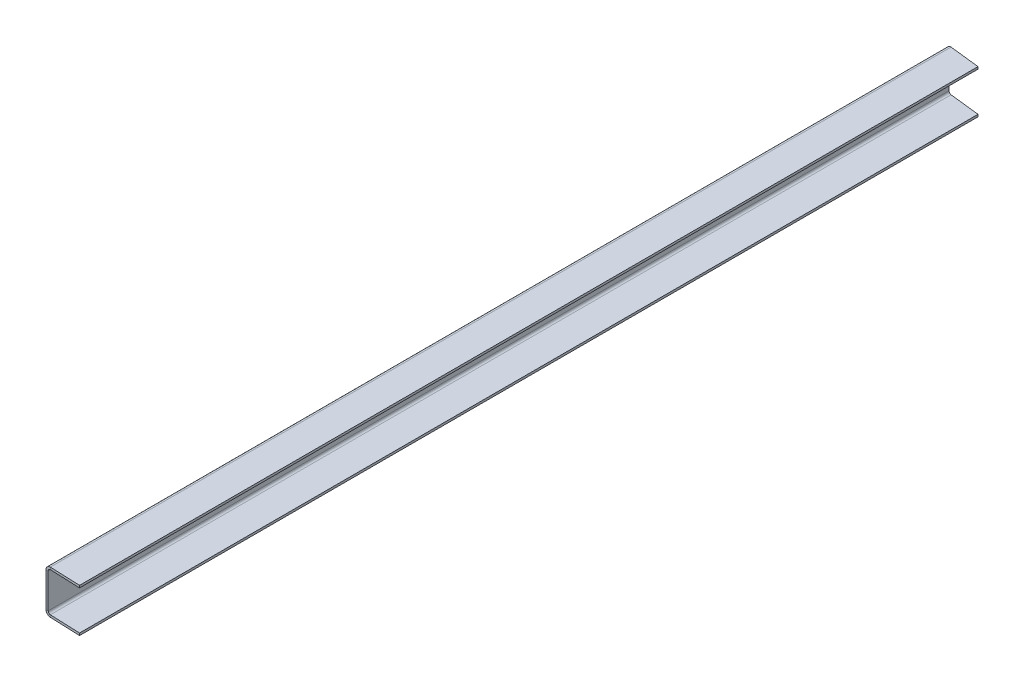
ISO-10303-21;
HEADER;
FILE_DESCRIPTION(('STEP AP214'),'2;1');
FILE_NAME('part.step','',(''),(''),'','','');
FILE_SCHEMA(('AUTOMOTIVE_DESIGN { 1 0 10303 214 1 1 1 1 }'));
ENDSEC;
DATA;
#1=APPLICATION_CONTEXT('core data for automotive mechanical design processes');
#2=APPLICATION_PROTOCOL_DEFINITION('international standard','automotive_design',2000,#1);
#3=PRODUCT_CONTEXT('',#1,'mechanical');
#4=PRODUCT('Part','Part','',(#3));
#5=PRODUCT_RELATED_PRODUCT_CATEGORY('part','',(#4));
#6=PRODUCT_DEFINITION_FORMATION('','',#4);
#7=PRODUCT_DEFINITION_CONTEXT('part definition',#1,'design');
#8=PRODUCT_DEFINITION('design','',#6,#7);
#9=PRODUCT_DEFINITION_SHAPE('','',#8);
#10=(LENGTH_UNIT() NAMED_UNIT(*) SI_UNIT(.MILLI.,.METRE.));
#11=(NAMED_UNIT(*) PLANE_ANGLE_UNIT() SI_UNIT($,.RADIAN.));
#12=(NAMED_UNIT(*) SI_UNIT($,.STERADIAN.) SOLID_ANGLE_UNIT());
#13=UNCERTAINTY_MEASURE_WITH_UNIT(LENGTH_MEASURE(1.E-05),#10,'distance_accuracy_value','');
#14=(GEOMETRIC_REPRESENTATION_CONTEXT(3) GLOBAL_UNCERTAINTY_ASSIGNED_CONTEXT((#13)) GLOBAL_UNIT_ASSIGNED_CONTEXT((#10,
#11,#12)) REPRESENTATION_CONTEXT('',''));
#15=CARTESIAN_POINT('',(0.,0.,0.));
#16=DIRECTION('',(0.,0.,1.));
#17=DIRECTION('',(1.,0.,0.));
#18=AXIS2_PLACEMENT_3D('',#15,#16,#17);
#19=CARTESIAN_POINT('',(2931.20159668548,0.,-1293.76501369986));
#20=DIRECTION('',(0.,0.,1.));
#21=DIRECTION('',(0.,-1.,0.));
#22=AXIS2_PLACEMENT_3D('',#19,#20,#21);
#23=PLANE('',#22);
#24=DIRECTION('',(1.,0.,0.));
#25=VECTOR('',#24,1.);
#26=CARTESIAN_POINT('',(2931.20159668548,781.78922918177,-1293.76501369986));
#27=LINE('',#26,#25);
#28=CARTESIAN_POINT('',(2929.57599668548,781.78922918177,-1293.76501369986));
#29=VERTEX_POINT('',#28);
#30=CARTESIAN_POINT('',(2931.20159668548,781.78922918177,-1293.76501369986));
#31=VERTEX_POINT('',#30);
#32=EDGE_CURVE('E12',#29,#31,#27,.T.);
#33=ORIENTED_EDGE('',*,*,#32,.F.);
#34=DIRECTION('',(0.,1.,0.));
#35=VECTOR('',#34,1.);
#36=CARTESIAN_POINT('',(2929.57599668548,0.,-1293.76501369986));
#37=LINE('',#36,#35);
#38=CARTESIAN_POINT('',(2929.57599668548,807.036829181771,-1293.76501369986));
#39=VERTEX_POINT('',#38);
#40=EDGE_CURVE('E137',#39,#29,#37,.F.);
#41=ORIENTED_EDGE('',*,*,#40,.F.);
#42=DIRECTION('',(1.,1.36592399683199E-13,0.));
#43=VECTOR('',#42,1.);
#44=CARTESIAN_POINT('',(2931.20159668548,807.036829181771,-1293.76501369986));
#45=LINE('',#44,#43);
#46=CARTESIAN_POINT('',(2931.20159668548,807.036829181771,-1293.76501369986));
#47=VERTEX_POINT('',#46);
#48=EDGE_CURVE('E90',#39,#47,#45,.T.);
#49=ORIENTED_EDGE('',*,*,#48,.T.);
#50=DIRECTION('',(0.,-1.,0.));
#51=VECTOR('',#50,1.);
#52=CARTESIAN_POINT('',(2931.20159668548,0.,-1293.76501369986));
#53=LINE('',#52,#51);
#54=EDGE_CURVE('E139',#47,#31,#53,.T.);
#55=ORIENTED_EDGE('',*,*,#54,.T.);
#56=EDGE_LOOP('',(#33,#41,#49,#55));
#57=FACE_BOUND('',#56,.T.);
#58=ADVANCED_FACE('F78',(#57),#23,.F.);
#59=CARTESIAN_POINT('',(2936.07839668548,807.036829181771,-1293.3968247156));
#60=CARTESIAN_POINT('',(2935.53653001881,807.036829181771,-1293.3968247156));
#61=CARTESIAN_POINT('',(2934.99466335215,807.036829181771,-1293.3968247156));
#62=CARTESIAN_POINT('',(2934.45279668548,807.036829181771,-1293.3968247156));
#63=CARTESIAN_POINT('',(2936.07839668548,800.534429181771,-1293.3968247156));
#64=CARTESIAN_POINT('',(2935.53653001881,801.618162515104,-1293.3968247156));
#65=CARTESIAN_POINT('',(2934.99466335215,802.701895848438,-1293.3968247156));
#66=CARTESIAN_POINT('',(2934.45279668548,803.785629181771,-1293.3968247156));
#67=CARTESIAN_POINT('',(2929.57599668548,800.534429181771,-1293.76501369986));
#68=CARTESIAN_POINT('',(2930.11786335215,801.618162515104,-1293.76501369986));
#69=CARTESIAN_POINT('',(2930.65973001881,802.701895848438,-1293.76501369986));
#70=CARTESIAN_POINT('',(2931.20159668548,803.785629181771,-1293.76501369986));
#71=CARTESIAN_POINT('',(2929.57599668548,807.036829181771,-1293.76501369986));
#72=CARTESIAN_POINT('',(2930.11786335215,807.036829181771,-1293.76501369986));
#73=CARTESIAN_POINT('',(2930.65973001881,807.036829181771,-1293.76501369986));
#74=CARTESIAN_POINT('',(2931.20159668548,807.036829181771,-1293.76501369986));
#75=CARTESIAN_POINT('',(2929.57599668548,813.539229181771,-1293.76501369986));
#76=CARTESIAN_POINT('',(2930.11786335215,812.455495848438,-1293.76501369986));
#77=CARTESIAN_POINT('',(2930.65973001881,811.371762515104,-1293.76501369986));
#78=CARTESIAN_POINT('',(2931.20159668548,810.288029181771,-1293.76501369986));
#79=CARTESIAN_POINT('',(2936.07839668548,813.539229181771,-1293.3968247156));
#80=CARTESIAN_POINT('',(2935.53653001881,812.455495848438,-1293.3968247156));
#81=CARTESIAN_POINT('',(2934.99466335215,811.371762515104,-1293.3968247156));
#82=CARTESIAN_POINT('',(2934.45279668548,810.288029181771,-1293.3968247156));
#83=CARTESIAN_POINT('',(2936.07839668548,807.036829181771,-1293.3968247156));
#84=CARTESIAN_POINT('',(2935.53653001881,807.036829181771,-1293.3968247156));
#85=CARTESIAN_POINT('',(2934.99466335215,807.036829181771,-1293.3968247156));
#86=CARTESIAN_POINT('',(2934.45279668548,807.036829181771,-1293.3968247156));
#87=(BOUNDED_SURFACE() B_SPLINE_SURFACE(3,3,((#59,#60,#61,#62),(#63,#64,#65,#66),(#67,#68,#69,
#70),(#71,#72,#73,#74),(#75,#76,#77,#78),(#79,#80,#81,#82),(#83,#84,#85,#86)),.UNSPECIFIED.,.T.,
.F.,.F.) B_SPLINE_SURFACE_WITH_KNOTS((4,3,4),(4,4),(0.,0.5,1.),(0.,1.),
.UNSPECIFIED.) GEOMETRIC_REPRESENTATION_ITEM() RATIONAL_B_SPLINE_SURFACE(((1.,1.,1.,1.),
(0.333333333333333,0.333333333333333,0.333333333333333,0.333333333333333),(0.333333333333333,
0.333333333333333,0.333333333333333,0.333333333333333),(1.,1.,1.,1.),(0.333333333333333,
0.333333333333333,0.333333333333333,0.333333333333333),(0.333333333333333,0.333333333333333,
0.333333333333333,0.333333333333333),(1.,1.,1.,1.))) REPRESENTATION_ITEM('') SURFACE());
#88=CARTESIAN_POINT('',(2932.82719668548,807.036829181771,-1293.58091920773));
#89=DIRECTION('',(-0.0565329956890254,0.,0.998400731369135));
#90=DIRECTION('',(0.998400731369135,0.,0.0565329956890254));
#91=AXIS2_PLACEMENT_3D('',#88,#89,#90);
#92=ELLIPSE('',#91,3.25640787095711,3.2512);
#93=CARTESIAN_POINT('',(2932.82719668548,810.288029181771,-1293.58091920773));
#94=VERTEX_POINT('',#93);
#95=EDGE_CURVE('E215',#39,#94,#92,.F.);
#96=DIRECTION('',(0.,-1.,0.));
#97=VECTOR('',#96,1.);
#98=CARTESIAN_POINT('',(2932.82719668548,808.662429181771,-1293.58091920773));
#99=LINE('',#98,#97);
#100=CARTESIAN_POINT('',(2932.82719668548,808.662429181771,-1293.58091920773));
#101=VERTEX_POINT('',#100);
#102=EDGE_CURVE('E205',#94,#101,#99,.T.);
#103=CARTESIAN_POINT('',(2932.82719668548,807.036829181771,-1293.58091920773));
#104=DIRECTION('',(-0.112527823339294,0.,0.993648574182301));
#105=DIRECTION('',(0.993648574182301,0.,0.112527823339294));
#106=AXIS2_PLACEMENT_3D('',#103,#104,#105);
#107=ELLIPSE('',#106,1.63599087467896,1.6256);
#108=EDGE_CURVE('E213',#47,#101,#107,.F.);
#109=ORIENTED_EDGE('',*,*,#48,.F.);
#110=ORIENTED_EDGE('',*,*,#95,.T.);
#111=ORIENTED_EDGE('',*,*,#102,.T.);
#112=ORIENTED_EDGE('',*,*,#108,.F.);
#113=EDGE_LOOP('',(#109,#110,#111,#112));
#114=FACE_BOUND('',#113,.T.);
#115=ADVANCED_FACE('F212',(#114),#87,.T.);
#116=CARTESIAN_POINT('',(2929.5863215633,808.662429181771,-1293.94793892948));
#117=DIRECTION('',(-0.112527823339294,0.,0.993648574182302));
#118=DIRECTION('',(-0.993648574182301,0.,-0.112527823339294));
#119=AXIS2_PLACEMENT_3D('',#116,#117,#118);
#120=PLANE('',#119);
#121=ORIENTED_EDGE('',*,*,#102,.F.);
#122=DIRECTION('',(-0.993648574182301,0.,-0.112527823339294));
#123=VECTOR('',#122,1.);
#124=CARTESIAN_POINT('',(2929.5863215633,810.288029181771,-1293.94793892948));
#125=LINE('',#124,#123);
#126=CARTESIAN_POINT('',(2954.9863215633,810.288029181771,-1291.07146248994));
#127=VERTEX_POINT('',#126);
#128=EDGE_CURVE('E176',#127,#94,#125,.T.);
#129=ORIENTED_EDGE('',*,*,#128,.F.);
#130=DIRECTION('',(0.,-1.,0.));
#131=VECTOR('',#130,1.);
#132=CARTESIAN_POINT('',(2954.9863215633,808.662429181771,-1291.07146248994));
#133=LINE('',#132,#131);
#134=CARTESIAN_POINT('',(2954.9863215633,808.662429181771,-1291.07146248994));
#135=VERTEX_POINT('',#134);
#136=EDGE_CURVE('E202',#127,#135,#133,.T.);
#137=ORIENTED_EDGE('',*,*,#136,.T.);
#138=DIRECTION('',(-0.993648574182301,0.,-0.112527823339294));
#139=VECTOR('',#138,1.);
#140=CARTESIAN_POINT('',(2929.5863215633,808.662429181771,-1293.94793892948));
#141=LINE('',#140,#139);
#142=EDGE_CURVE('E232',#135,#101,#141,.T.);
#143=ORIENTED_EDGE('',*,*,#142,.T.);
#144=EDGE_LOOP('',(#121,#129,#137,#143));
#145=FACE_BOUND('',#144,.T.);
#146=ADVANCED_FACE('F233',(#145),#120,.F.);
#147=CARTESIAN_POINT('',(2954.9863215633,808.662429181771,-1291.07146248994));
#148=DIRECTION('',(-1.,0.,0.));
#149=DIRECTION('',(0.,0.,-1.));
#150=AXIS2_PLACEMENT_3D('',#147,#148,#149);
#151=PLANE('',#150);
#152=ORIENTED_EDGE('',*,*,#136,.F.);
#153=DIRECTION('',(0.,0.,-1.));
#154=VECTOR('',#153,1.);
#155=CARTESIAN_POINT('',(2954.9863215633,810.288029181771,0.));
#156=LINE('',#155,#154);
#157=CARTESIAN_POINT('',(2954.9863215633,810.288029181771,-635.693927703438));
#158=VERTEX_POINT('',#157);
#159=EDGE_CURVE('E168',#158,#127,#156,.T.);
#160=ORIENTED_EDGE('',*,*,#159,.F.);
#161=DIRECTION('',(0.,-1.,0.));
#162=VECTOR('',#161,1.);
#163=CARTESIAN_POINT('',(2954.9863215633,808.662429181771,-635.693927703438));
#164=LINE('',#163,#162);
#165=CARTESIAN_POINT('',(2954.9863215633,808.662429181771,-635.693927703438));
#166=VERTEX_POINT('',#165);
#167=EDGE_CURVE('E199',#158,#166,#164,.T.);
#168=ORIENTED_EDGE('',*,*,#167,.T.);
#169=DIRECTION('',(0.,0.,-1.));
#170=VECTOR('',#169,1.);
#171=CARTESIAN_POINT('',(2954.9863215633,808.662429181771,-1291.07146248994));
#172=LINE('',#171,#170);
#173=EDGE_CURVE('E237',#166,#135,#172,.T.);
#174=ORIENTED_EDGE('',*,*,#173,.T.);
#175=EDGE_LOOP('',(#152,#160,#168,#174));
#176=FACE_BOUND('',#175,.T.);
#177=ADVANCED_FACE('F280',(#176),#151,.F.);
#178=CARTESIAN_POINT('',(2954.9863215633,808.662429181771,-635.693927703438));
#179=DIRECTION('',(0.0397709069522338,0.,-0.999208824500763));
#180=DIRECTION('',(0.999208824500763,0.,0.0397709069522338));
#181=AXIS2_PLACEMENT_3D('',#178,#179,#180);
#182=PLANE('',#181);
#183=ORIENTED_EDGE('',*,*,#167,.F.);
#184=DIRECTION('',(0.999208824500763,0.,0.0397709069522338));
#185=VECTOR('',#184,1.);
#186=CARTESIAN_POINT('',(2954.9863215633,810.288029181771,-635.693927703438));
#187=LINE('',#186,#185);
#188=CARTESIAN_POINT('',(2932.82719668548,810.288029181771,-636.575914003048));
#189=VERTEX_POINT('',#188);
#190=EDGE_CURVE('E173',#189,#158,#187,.T.);
#191=ORIENTED_EDGE('',*,*,#190,.F.);
#192=DIRECTION('',(0.,-1.,0.));
#193=VECTOR('',#192,1.);
#194=CARTESIAN_POINT('',(2932.82719668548,808.662429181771,-636.575914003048));
#195=LINE('',#194,#193);
#196=CARTESIAN_POINT('',(2932.82719668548,808.662429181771,-636.575914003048));
#197=VERTEX_POINT('',#196);
#198=EDGE_CURVE('E196',#189,#197,#195,.T.);
#199=ORIENTED_EDGE('',*,*,#198,.T.);
#200=DIRECTION('',(0.999208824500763,0.,0.0397709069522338));
#201=VECTOR('',#200,1.);
#202=CARTESIAN_POINT('',(2954.9863215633,808.662429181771,-635.693927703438));
#203=LINE('',#202,#201);
#204=EDGE_CURVE('E238',#197,#166,#203,.T.);
#205=ORIENTED_EDGE('',*,*,#204,.T.);
#206=EDGE_LOOP('',(#183,#191,#199,#205));
#207=FACE_BOUND('',#206,.T.);
#208=ADVANCED_FACE('F307',(#207),#182,.F.);
#209=CARTESIAN_POINT('',(2936.07839668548,807.036829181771,-636.511211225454));
#210=CARTESIAN_POINT('',(2935.53653001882,807.036829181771,-636.511211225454));
#211=CARTESIAN_POINT('',(2934.99466335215,807.036829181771,-636.511211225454));
#212=CARTESIAN_POINT('',(2934.45279668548,807.036829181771,-636.511211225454));
#213=CARTESIAN_POINT('',(2936.07839668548,813.539229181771,-636.511211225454));
#214=CARTESIAN_POINT('',(2935.53653001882,812.455495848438,-636.511211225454));
#215=CARTESIAN_POINT('',(2934.99466335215,811.371762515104,-636.511211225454));
#216=CARTESIAN_POINT('',(2934.45279668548,810.288029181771,-636.511211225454));
#217=CARTESIAN_POINT('',(2929.57599668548,813.539229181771,-636.640616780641));
#218=CARTESIAN_POINT('',(2930.11786335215,812.455495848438,-636.640616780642));
#219=CARTESIAN_POINT('',(2930.65973001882,811.371762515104,-636.640616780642));
#220=CARTESIAN_POINT('',(2931.20159668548,810.288029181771,-636.640616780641));
#221=CARTESIAN_POINT('',(2929.57599668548,807.036829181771,-636.640616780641));
#222=CARTESIAN_POINT('',(2930.11786335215,807.036829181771,-636.640616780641));
#223=CARTESIAN_POINT('',(2930.65973001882,807.036829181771,-636.640616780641));
#224=CARTESIAN_POINT('',(2931.20159668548,807.036829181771,-636.640616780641));
#225=CARTESIAN_POINT('',(2929.57599668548,800.534429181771,-636.640616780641));
#226=CARTESIAN_POINT('',(2930.11786335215,801.618162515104,-636.640616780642));
#227=CARTESIAN_POINT('',(2930.65973001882,802.701895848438,-636.640616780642));
#228=CARTESIAN_POINT('',(2931.20159668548,803.785629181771,-636.640616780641));
#229=CARTESIAN_POINT('',(2936.07839668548,800.534429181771,-636.511211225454));
#230=CARTESIAN_POINT('',(2935.53653001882,801.618162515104,-636.511211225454));
#231=CARTESIAN_POINT('',(2934.99466335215,802.701895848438,-636.511211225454));
#232=CARTESIAN_POINT('',(2934.45279668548,803.785629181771,-636.511211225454));
#233=CARTESIAN_POINT('',(2936.07839668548,807.036829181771,-636.511211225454));
#234=CARTESIAN_POINT('',(2935.53653001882,807.036829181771,-636.511211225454));
#235=CARTESIAN_POINT('',(2934.99466335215,807.036829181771,-636.511211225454));
#236=CARTESIAN_POINT('',(2934.45279668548,807.036829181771,-636.511211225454));
#237=(BOUNDED_SURFACE() B_SPLINE_SURFACE(3,3,((#209,#210,#211,#212),(#213,#214,#215,#216),(#217,
#218,#219,#220),(#221,#222,#223,#224),(#225,#226,#227,#228),(#229,#230,#231,#232),(#233,#234,
#235,#236)),.UNSPECIFIED.,.T.,.F.,.F.) B_SPLINE_SURFACE_WITH_KNOTS((4,3,4),(4,4),(0.,0.5,1.),
(0.,1.),.UNSPECIFIED.) GEOMETRIC_REPRESENTATION_ITEM() RATIONAL_B_SPLINE_SURFACE(((1.,1.,1.,1.),
(0.333333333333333,0.333333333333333,0.333333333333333,0.333333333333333),(0.333333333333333,
0.333333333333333,0.333333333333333,0.333333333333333),(1.,1.,1.,1.),(0.333333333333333,
0.333333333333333,0.333333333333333,0.333333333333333),(0.333333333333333,0.333333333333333,
0.333333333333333,0.333333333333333),(1.,1.,1.,1.))) REPRESENTATION_ITEM('') SURFACE());
#238=CARTESIAN_POINT('',(2932.82719668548,807.036829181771,-636.575914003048));
#239=DIRECTION('',(0.0198972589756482,0.,-0.999802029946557));
#240=DIRECTION('',(0.999802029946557,0.,0.0198972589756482));
#241=AXIS2_PLACEMENT_3D('',#238,#239,#240);
#242=ELLIPSE('',#241,3.25184376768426,3.2512);
#243=CARTESIAN_POINT('',(2929.57599668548,807.036829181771,-636.640616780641));
#244=VERTEX_POINT('',#243);
#245=EDGE_CURVE('E178',#189,#244,#242,.F.);
#246=DIRECTION('',(1.,0.,0.));
#247=VECTOR('',#246,1.);
#248=CARTESIAN_POINT('',(2931.20159668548,807.036829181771,-636.640616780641));
#249=LINE('',#248,#247);
#250=CARTESIAN_POINT('',(2931.20159668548,807.036829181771,-636.640616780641));
#251=VERTEX_POINT('',#250);
#252=EDGE_CURVE('E194',#244,#251,#249,.T.);
#253=CARTESIAN_POINT('',(2932.82719668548,807.036829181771,-636.575914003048));
#254=DIRECTION('',(0.0397709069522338,0.,-0.999208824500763));
#255=DIRECTION('',(0.999208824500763,0.,0.0397709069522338));
#256=AXIS2_PLACEMENT_3D('',#253,#254,#255);
#257=ELLIPSE('',#256,1.62688715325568,1.6256);
#258=EDGE_CURVE('E229',#197,#251,#257,.F.);
#259=ORIENTED_EDGE('',*,*,#198,.F.);
#260=ORIENTED_EDGE('',*,*,#245,.T.);
#261=ORIENTED_EDGE('',*,*,#252,.T.);
#262=ORIENTED_EDGE('',*,*,#258,.F.);
#263=EDGE_LOOP('',(#259,#260,#261,#262));
#264=FACE_BOUND('',#263,.T.);
#265=ADVANCED_FACE('F357',(#264),#237,.T.);
#266=CARTESIAN_POINT('',(2931.20159668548,0.,-636.640616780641));
#267=DIRECTION('',(0.,0.,-1.));
#268=DIRECTION('',(0.,1.,0.));
#269=AXIS2_PLACEMENT_3D('',#266,#267,#268);
#270=PLANE('',#269);
#271=ORIENTED_EDGE('',*,*,#252,.F.);
#272=DIRECTION('',(0.,1.,0.));
#273=VECTOR('',#272,1.);
#274=CARTESIAN_POINT('',(2929.57599668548,0.,-636.640616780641));
#275=LINE('',#274,#273);
#276=CARTESIAN_POINT('',(2929.57599668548,781.789229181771,-636.640616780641));
#277=VERTEX_POINT('',#276);
#278=EDGE_CURVE('E167',#277,#244,#275,.T.);
#279=ORIENTED_EDGE('',*,*,#278,.F.);
#280=DIRECTION('',(1.,0.,0.));
#281=VECTOR('',#280,1.);
#282=CARTESIAN_POINT('',(2931.20159668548,781.789229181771,-636.640616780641));
#283=LINE('',#282,#281);
#284=CARTESIAN_POINT('',(2931.20159668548,781.789229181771,-636.640616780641));
#285=VERTEX_POINT('',#284);
#286=EDGE_CURVE('E191',#277,#285,#283,.T.);
#287=ORIENTED_EDGE('',*,*,#286,.T.);
#288=DIRECTION('',(0.,1.,0.));
#289=VECTOR('',#288,1.);
#290=CARTESIAN_POINT('',(2931.20159668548,0.,-636.640616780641));
#291=LINE('',#290,#289);
#292=EDGE_CURVE('E284',#285,#251,#291,.T.);
#293=ORIENTED_EDGE('',*,*,#292,.T.);
#294=EDGE_LOOP('',(#271,#279,#287,#293));
#295=FACE_BOUND('',#294,.T.);
#296=ADVANCED_FACE('F322',(#295),#270,.F.);
#297=CARTESIAN_POINT('',(2929.57599668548,781.789229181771,-636.640616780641));
#298=CARTESIAN_POINT('',(2930.11786335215,781.789229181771,-636.640616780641));
#299=CARTESIAN_POINT('',(2930.65973001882,781.789229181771,-636.640616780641));
#300=CARTESIAN_POINT('',(2931.20159668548,781.789229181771,-636.640616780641));
#301=CARTESIAN_POINT('',(2929.57599668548,775.286829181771,-636.640616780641));
#302=CARTESIAN_POINT('',(2930.11786335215,776.370562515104,-636.640616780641));
#303=CARTESIAN_POINT('',(2930.65973001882,777.454295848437,-636.640616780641));
#304=CARTESIAN_POINT('',(2931.20159668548,778.538029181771,-636.640616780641));
#305=CARTESIAN_POINT('',(2936.07839668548,775.286829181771,-636.511211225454));
#306=CARTESIAN_POINT('',(2935.53653001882,776.370562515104,-636.511211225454));
#307=CARTESIAN_POINT('',(2934.99466335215,777.454295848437,-636.511211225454));
#308=CARTESIAN_POINT('',(2934.45279668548,778.538029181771,-636.511211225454));
#309=CARTESIAN_POINT('',(2936.07839668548,781.789229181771,-636.511211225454));
#310=CARTESIAN_POINT('',(2935.53653001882,781.789229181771,-636.511211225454));
#311=CARTESIAN_POINT('',(2934.99466335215,781.789229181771,-636.511211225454));
#312=CARTESIAN_POINT('',(2934.45279668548,781.789229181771,-636.511211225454));
#313=CARTESIAN_POINT('',(2936.07839668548,788.291629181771,-636.511211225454));
#314=CARTESIAN_POINT('',(2935.53653001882,787.207895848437,-636.511211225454));
#315=CARTESIAN_POINT('',(2934.99466335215,786.124162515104,-636.511211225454));
#316=CARTESIAN_POINT('',(2934.45279668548,785.040429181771,-636.511211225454));
#317=CARTESIAN_POINT('',(2929.57599668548,788.291629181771,-636.640616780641));
#318=CARTESIAN_POINT('',(2930.11786335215,787.207895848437,-636.640616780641));
#319=CARTESIAN_POINT('',(2930.65973001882,786.124162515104,-636.640616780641));
#320=CARTESIAN_POINT('',(2931.20159668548,785.040429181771,-636.640616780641));
#321=CARTESIAN_POINT('',(2929.57599668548,781.789229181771,-636.640616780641));
#322=CARTESIAN_POINT('',(2930.11786335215,781.789229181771,-636.640616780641));
#323=CARTESIAN_POINT('',(2930.65973001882,781.789229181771,-636.640616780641));
#324=CARTESIAN_POINT('',(2931.20159668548,781.789229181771,-636.640616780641));
#325=(BOUNDED_SURFACE() B_SPLINE_SURFACE(3,3,((#297,#298,#299,#300),(#301,#302,#303,#304),(#305,
#306,#307,#308),(#309,#310,#311,#312),(#313,#314,#315,#316),(#317,#318,#319,#320),(#321,#322,
#323,#324)),.UNSPECIFIED.,.T.,.F.,.F.) B_SPLINE_SURFACE_WITH_KNOTS((4,3,4),(4,4),(0.,0.5,1.),
(0.,1.),.UNSPECIFIED.) GEOMETRIC_REPRESENTATION_ITEM() RATIONAL_B_SPLINE_SURFACE(((1.,1.,1.,1.),
(0.333333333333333,0.333333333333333,0.333333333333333,0.333333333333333),(0.333333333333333,
0.333333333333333,0.333333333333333,0.333333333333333),(1.,1.,1.,1.),(0.333333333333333,
0.333333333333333,0.333333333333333,0.333333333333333),(0.333333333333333,0.333333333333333,
0.333333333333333,0.333333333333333),(1.,1.,1.,1.))) REPRESENTATION_ITEM('') SURFACE());
#326=CARTESIAN_POINT('',(2932.82719668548,781.789229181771,-636.575914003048));
#327=DIRECTION('',(0.019897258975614,0.,-0.999802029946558));
#328=DIRECTION('',(-0.999802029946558,0.,-0.019897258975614));
#329=AXIS2_PLACEMENT_3D('',#326,#327,#328);
#330=ELLIPSE('',#329,3.25184376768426,3.2512);
#331=CARTESIAN_POINT('',(2932.82719668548,778.538029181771,-636.575914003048));
#332=VERTEX_POINT('',#331);
#333=EDGE_CURVE('E155',#277,#332,#330,.F.);
#334=DIRECTION('',(0.,1.,0.));
#335=VECTOR('',#334,1.);
#336=CARTESIAN_POINT('',(2932.82719668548,780.163629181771,-636.575914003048));
#337=LINE('',#336,#335);
#338=CARTESIAN_POINT('',(2932.82719668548,780.163629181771,-636.575914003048));
#339=VERTEX_POINT('',#338);
#340=EDGE_CURVE('E188',#332,#339,#337,.T.);
#341=CARTESIAN_POINT('',(2932.82719668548,781.789229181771,-636.575914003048));
#342=DIRECTION('',(0.0397709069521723,0.,-0.999208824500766));
#343=DIRECTION('',(-0.999208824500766,0.,-0.0397709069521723));
#344=AXIS2_PLACEMENT_3D('',#341,#342,#343);
#345=ELLIPSE('',#344,1.62688715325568,1.6256);
#346=EDGE_CURVE('E254',#285,#339,#345,.F.);
#347=ORIENTED_EDGE('',*,*,#286,.F.);
#348=ORIENTED_EDGE('',*,*,#333,.T.);
#349=ORIENTED_EDGE('',*,*,#340,.T.);
#350=ORIENTED_EDGE('',*,*,#346,.F.);
#351=EDGE_LOOP('',(#347,#348,#349,#350));
#352=FACE_BOUND('',#351,.T.);
#353=ADVANCED_FACE('F326',(#352),#325,.T.);
#354=CARTESIAN_POINT('',(2929.5863215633,780.163629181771,-636.704908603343));
#355=DIRECTION('',(0.0397709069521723,0.,-0.999208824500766));
#356=DIRECTION('',(-0.999208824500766,0.,-0.0397709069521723));
#357=AXIS2_PLACEMENT_3D('',#354,#355,#356);
#358=PLANE('',#357);
#359=ORIENTED_EDGE('',*,*,#340,.F.);
#360=DIRECTION('',(-0.999208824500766,0.,-0.0397709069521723));
#361=VECTOR('',#360,1.);
#362=CARTESIAN_POINT('',(2929.5863215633,778.538029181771,-636.704908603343));
#363=LINE('',#362,#361);
#364=CARTESIAN_POINT('',(2954.98632156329,778.538029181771,-635.69392770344));
#365=VERTEX_POINT('',#364);
#366=EDGE_CURVE('E262',#365,#332,#363,.T.);
#367=ORIENTED_EDGE('',*,*,#366,.F.);
#368=DIRECTION('',(0.,1.,0.));
#369=VECTOR('',#368,1.);
#370=CARTESIAN_POINT('',(2954.98632156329,780.163629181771,-635.69392770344));
#371=LINE('',#370,#369);
#372=CARTESIAN_POINT('',(2954.98632156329,780.163629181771,-635.69392770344));
#373=VERTEX_POINT('',#372);
#374=EDGE_CURVE('E185',#365,#373,#371,.T.);
#375=ORIENTED_EDGE('',*,*,#374,.T.);
#376=DIRECTION('',(-0.999208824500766,0.,-0.0397709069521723));
#377=VECTOR('',#376,1.);
#378=CARTESIAN_POINT('',(2929.5863215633,780.163629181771,-636.704908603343));
#379=LINE('',#378,#377);
#380=EDGE_CURVE('E293',#373,#339,#379,.T.);
#381=ORIENTED_EDGE('',*,*,#380,.T.);
#382=EDGE_LOOP('',(#359,#367,#375,#381));
#383=FACE_BOUND('',#382,.T.);
#384=ADVANCED_FACE('F374',(#383),#358,.F.);
#385=CARTESIAN_POINT('',(2954.98632156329,780.163629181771,-635.69392770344));
#386=DIRECTION('',(-1.,0.,0.));
#387=DIRECTION('',(0.,0.,1.));
#388=AXIS2_PLACEMENT_3D('',#385,#386,#387);
#389=PLANE('',#388);
#390=ORIENTED_EDGE('',*,*,#374,.F.);
#391=DIRECTION('',(0.,0.,1.));
#392=VECTOR('',#391,1.);
#393=CARTESIAN_POINT('',(2954.98632156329,778.538029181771,-1.37228090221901E-13));
#394=LINE('',#393,#392);
#395=CARTESIAN_POINT('',(2954.98632156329,778.538029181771,-1291.07146248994));
#396=VERTEX_POINT('',#395);
#397=EDGE_CURVE('E255',#396,#365,#394,.T.);
#398=ORIENTED_EDGE('',*,*,#397,.F.);
#399=DIRECTION('',(0.,1.,0.));
#400=VECTOR('',#399,1.);
#401=CARTESIAN_POINT('',(2954.98632156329,780.16362918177,-1291.07146248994));
#402=LINE('',#401,#400);
#403=CARTESIAN_POINT('',(2954.98632156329,780.16362918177,-1291.07146248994));
#404=VERTEX_POINT('',#403);
#405=EDGE_CURVE('E182',#396,#404,#402,.T.);
#406=ORIENTED_EDGE('',*,*,#405,.T.);
#407=DIRECTION('',(0.,0.,1.));
#408=VECTOR('',#407,1.);
#409=CARTESIAN_POINT('',(2954.98632156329,780.163629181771,-635.69392770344));
#410=LINE('',#409,#408);
#411=EDGE_CURVE('E296',#404,#373,#410,.T.);
#412=ORIENTED_EDGE('',*,*,#411,.T.);
#413=EDGE_LOOP('',(#390,#398,#406,#412));
#414=FACE_BOUND('',#413,.T.);
#415=ADVANCED_FACE('F382',(#414),#389,.F.);
#416=CARTESIAN_POINT('',(2954.98632156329,780.16362918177,-1291.07146248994));
#417=DIRECTION('',(-0.112527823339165,0.,0.993648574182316));
#418=DIRECTION('',(0.993648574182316,0.,0.112527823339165));
#419=AXIS2_PLACEMENT_3D('',#416,#417,#418);
#420=PLANE('',#419);
#421=ORIENTED_EDGE('',*,*,#405,.F.);
#422=DIRECTION('',(0.993648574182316,0.,0.112527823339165));
#423=VECTOR('',#422,1.);
#424=CARTESIAN_POINT('',(2954.98632156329,778.538029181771,-1291.07146248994));
#425=LINE('',#424,#423);
#426=CARTESIAN_POINT('',(2932.82719668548,778.538029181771,-1293.58091920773));
#427=VERTEX_POINT('',#426);
#428=EDGE_CURVE('E259',#427,#396,#425,.T.);
#429=ORIENTED_EDGE('',*,*,#428,.F.);
#430=DIRECTION('',(0.,1.,0.));
#431=VECTOR('',#430,1.);
#432=CARTESIAN_POINT('',(2932.82719668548,780.16362918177,-1293.58091920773));
#433=LINE('',#432,#431);
#434=CARTESIAN_POINT('',(2932.82719668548,780.16362918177,-1293.58091920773));
#435=VERTEX_POINT('',#434);
#436=EDGE_CURVE('E84',#427,#435,#433,.T.);
#437=ORIENTED_EDGE('',*,*,#436,.T.);
#438=DIRECTION('',(0.993648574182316,0.,0.112527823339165));
#439=VECTOR('',#438,1.);
#440=CARTESIAN_POINT('',(2954.98632156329,780.16362918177,-1291.07146248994));
#441=LINE('',#440,#439);
#442=EDGE_CURVE('E290',#435,#404,#441,.T.);
#443=ORIENTED_EDGE('',*,*,#442,.T.);
#444=EDGE_LOOP('',(#421,#429,#437,#443));
#445=FACE_BOUND('',#444,.T.);
#446=ADVANCED_FACE('F386',(#445),#420,.F.);
#447=CARTESIAN_POINT('',(2929.57599668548,781.789229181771,-1293.76501369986));
#448=CARTESIAN_POINT('',(2930.11786335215,781.789229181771,-1293.76501369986));
#449=CARTESIAN_POINT('',(2930.65973001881,781.789229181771,-1293.76501369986));
#450=CARTESIAN_POINT('',(2931.20159668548,781.789229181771,-1293.76501369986));
#451=CARTESIAN_POINT('',(2929.57599668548,788.291629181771,-1293.76501369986));
#452=CARTESIAN_POINT('',(2930.11786335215,787.207895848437,-1293.76501369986));
#453=CARTESIAN_POINT('',(2930.65973001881,786.124162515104,-1293.76501369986));
#454=CARTESIAN_POINT('',(2931.20159668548,785.040429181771,-1293.76501369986));
#455=CARTESIAN_POINT('',(2936.07839668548,788.291629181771,-1293.3968247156));
#456=CARTESIAN_POINT('',(2935.53653001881,787.207895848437,-1293.3968247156));
#457=CARTESIAN_POINT('',(2934.99466335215,786.124162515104,-1293.3968247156));
#458=CARTESIAN_POINT('',(2934.45279668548,785.040429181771,-1293.3968247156));
#459=CARTESIAN_POINT('',(2936.07839668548,781.789229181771,-1293.3968247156));
#460=CARTESIAN_POINT('',(2935.53653001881,781.789229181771,-1293.3968247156));
#461=CARTESIAN_POINT('',(2934.99466335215,781.789229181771,-1293.3968247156));
#462=CARTESIAN_POINT('',(2934.45279668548,781.789229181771,-1293.3968247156));
#463=CARTESIAN_POINT('',(2936.07839668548,775.286829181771,-1293.3968247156));
#464=CARTESIAN_POINT('',(2935.53653001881,776.370562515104,-1293.3968247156));
#465=CARTESIAN_POINT('',(2934.99466335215,777.454295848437,-1293.3968247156));
#466=CARTESIAN_POINT('',(2934.45279668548,778.538029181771,-1293.3968247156));
#467=CARTESIAN_POINT('',(2929.57599668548,775.286829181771,-1293.76501369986));
#468=CARTESIAN_POINT('',(2930.11786335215,776.370562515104,-1293.76501369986));
#469=CARTESIAN_POINT('',(2930.65973001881,777.454295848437,-1293.76501369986));
#470=CARTESIAN_POINT('',(2931.20159668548,778.538029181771,-1293.76501369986));
#471=CARTESIAN_POINT('',(2929.57599668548,781.789229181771,-1293.76501369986));
#472=CARTESIAN_POINT('',(2930.11786335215,781.789229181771,-1293.76501369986));
#473=CARTESIAN_POINT('',(2930.65973001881,781.789229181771,-1293.76501369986));
#474=CARTESIAN_POINT('',(2931.20159668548,781.789229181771,-1293.76501369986));
#475=(BOUNDED_SURFACE() B_SPLINE_SURFACE(3,3,((#447,#448,#449,#450),(#451,#452,#453,#454),(#455,
#456,#457,#458),(#459,#460,#461,#462),(#463,#464,#465,#466),(#467,#468,#469,#470),(#471,#472,
#473,#474)),.UNSPECIFIED.,.T.,.F.,.F.) B_SPLINE_SURFACE_WITH_KNOTS((4,3,4),(4,4),(0.,0.5,1.),
(0.,1.),.UNSPECIFIED.) GEOMETRIC_REPRESENTATION_ITEM() RATIONAL_B_SPLINE_SURFACE(((1.,1.,1.,1.),
(0.333333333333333,0.333333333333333,0.333333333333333,0.333333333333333),(0.333333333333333,
0.333333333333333,0.333333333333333,0.333333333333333),(1.,1.,1.,1.),(0.333333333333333,
0.333333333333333,0.333333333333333,0.333333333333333),(0.333333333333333,0.333333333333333,
0.333333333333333,0.333333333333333),(1.,1.,1.,1.))) REPRESENTATION_ITEM('') SURFACE());
#476=CARTESIAN_POINT('',(2932.82719668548,781.789229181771,-1293.58091920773));
#477=DIRECTION('',(-0.0565329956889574,0.,0.99840073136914));
#478=DIRECTION('',(-0.998400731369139,0.,-0.0565329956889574));
#479=AXIS2_PLACEMENT_3D('',#476,#477,#478);
#480=ELLIPSE('',#479,3.2564078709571,3.2512);
#481=EDGE_CURVE('E152',#427,#29,#480,.F.);
#482=CARTESIAN_POINT('',(2932.82719668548,781.789229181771,-1293.58091920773));
#483=DIRECTION('',(-0.112527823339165,0.,0.993648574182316));
#484=DIRECTION('',(-0.993648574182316,0.,-0.112527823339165));
#485=AXIS2_PLACEMENT_3D('',#482,#483,#484);
#486=ELLIPSE('',#485,1.63599087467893,1.6256);
#487=EDGE_CURVE('E250',#435,#31,#486,.F.);
#488=ORIENTED_EDGE('',*,*,#481,.T.);
#489=ORIENTED_EDGE('',*,*,#32,.T.);
#490=ORIENTED_EDGE('',*,*,#487,.F.);
#491=ORIENTED_EDGE('',*,*,#436,.F.);
#492=EDGE_LOOP('',(#488,#489,#490,#491));
#493=FACE_BOUND('',#492,.T.);
#494=ADVANCED_FACE('F80',(#493),#475,.T.);
#495=CARTESIAN_POINT('',(-2.72678793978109E-13,780.163629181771,-1.3750268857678E-13));
#496=DIRECTION('',(0.,1.,0.));
#497=DIRECTION('',(0.,0.,1.));
#498=AXIS2_PLACEMENT_3D('',#495,#496,#497);
#499=PLANE('',#498);
#500=ORIENTED_EDGE('',*,*,#442,.F.);
#501=DIRECTION('',(0.,0.,1.));
#502=VECTOR('',#501,1.);
#503=CARTESIAN_POINT('',(2932.82719668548,780.163629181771,-636.640616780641));
#504=LINE('',#503,#502);
#505=EDGE_CURVE('E247',#435,#339,#504,.T.);
#506=ORIENTED_EDGE('',*,*,#505,.T.);
#507=ORIENTED_EDGE('',*,*,#380,.F.);
#508=ORIENTED_EDGE('',*,*,#411,.F.);
#509=EDGE_LOOP('',(#500,#506,#507,#508));
#510=FACE_BOUND('',#509,.T.);
#511=ADVANCED_FACE('F411',(#510),#499,.T.);
#512=CARTESIAN_POINT('',(2931.20159668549,0.,0.182925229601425));
#513=DIRECTION('',(1.,0.,0.));
#514=DIRECTION('',(0.,0.,-1.));
#515=AXIS2_PLACEMENT_3D('',#512,#513,#514);
#516=PLANE('',#515);
#517=ORIENTED_EDGE('',*,*,#54,.F.);
#518=DIRECTION('',(0.,0.,-1.));
#519=VECTOR('',#518,1.);
#520=CARTESIAN_POINT('',(2931.20159668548,807.036829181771,-636.640616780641));
#521=LINE('',#520,#519);
#522=EDGE_CURVE('E228',#47,#251,#521,.F.);
#523=ORIENTED_EDGE('',*,*,#522,.T.);
#524=ORIENTED_EDGE('',*,*,#292,.F.);
#525=DIRECTION('',(0.,0.,1.));
#526=VECTOR('',#525,1.);
#527=CARTESIAN_POINT('',(2931.20159668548,781.789229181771,-1293.76501369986));
#528=LINE('',#527,#526);
#529=EDGE_CURVE('E244',#285,#31,#528,.F.);
#530=ORIENTED_EDGE('',*,*,#529,.T.);
#531=EDGE_LOOP('',(#517,#523,#524,#530));
#532=FACE_BOUND('',#531,.T.);
#533=ADVANCED_FACE('F325',(#532),#516,.T.);
#534=CARTESIAN_POINT('',(0.,808.662429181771,0.));
#535=DIRECTION('',(0.,-1.,0.));
#536=DIRECTION('',(0.,0.,-1.));
#537=AXIS2_PLACEMENT_3D('',#534,#535,#536);
#538=PLANE('',#537);
#539=ORIENTED_EDGE('',*,*,#204,.F.);
#540=DIRECTION('',(0.,0.,-1.));
#541=VECTOR('',#540,1.);
#542=CARTESIAN_POINT('',(2932.82719668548,808.662429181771,-1293.76501369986));
#543=LINE('',#542,#541);
#544=EDGE_CURVE('E226',#197,#101,#543,.T.);
#545=ORIENTED_EDGE('',*,*,#544,.T.);
#546=ORIENTED_EDGE('',*,*,#142,.F.);
#547=ORIENTED_EDGE('',*,*,#173,.F.);
#548=EDGE_LOOP('',(#539,#545,#546,#547));
#549=FACE_BOUND('',#548,.T.);
#550=ADVANCED_FACE('F241',(#549),#538,.T.);
#551=CARTESIAN_POINT('',(2932.82719668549,781.789229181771,-1.9148817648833E-11));
#552=DIRECTION('',(0.,0.,-1.));
#553=DIRECTION('',(-1.,0.,0.));
#554=AXIS2_PLACEMENT_3D('',#551,#552,#553);
#555=CYLINDRICAL_SURFACE('',#554,1.6256);
#556=ORIENTED_EDGE('',*,*,#487,.T.);
#557=ORIENTED_EDGE('',*,*,#529,.F.);
#558=ORIENTED_EDGE('',*,*,#346,.T.);
#559=ORIENTED_EDGE('',*,*,#505,.F.);
#560=EDGE_LOOP('',(#556,#557,#558,#559));
#561=FACE_BOUND('',#560,.T.);
#562=ADVANCED_FACE('F327',(#561),#555,.F.);
#563=CARTESIAN_POINT('',(2932.82719668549,807.036829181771,-1.90167247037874E-11));
#564=DIRECTION('',(0.,0.,1.));
#565=DIRECTION('',(1.,0.,0.));
#566=AXIS2_PLACEMENT_3D('',#563,#564,#565);
#567=CYLINDRICAL_SURFACE('',#566,1.6256);
#568=ORIENTED_EDGE('',*,*,#258,.T.);
#569=ORIENTED_EDGE('',*,*,#522,.F.);
#570=ORIENTED_EDGE('',*,*,#108,.T.);
#571=ORIENTED_EDGE('',*,*,#544,.F.);
#572=EDGE_LOOP('',(#568,#569,#570,#571));
#573=FACE_BOUND('',#572,.T.);
#574=ADVANCED_FACE('F224',(#573),#567,.F.);
#575=CARTESIAN_POINT('',(-2.7270989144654E-13,778.538029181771,-1.37228090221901E-13));
#576=DIRECTION('',(0.,1.,0.));
#577=DIRECTION('',(0.,0.,1.));
#578=AXIS2_PLACEMENT_3D('',#575,#576,#577);
#579=PLANE('',#578);
#580=ORIENTED_EDGE('',*,*,#428,.T.);
#581=ORIENTED_EDGE('',*,*,#397,.T.);
#582=ORIENTED_EDGE('',*,*,#366,.T.);
#583=DIRECTION('',(0.,0.,1.));
#584=VECTOR('',#583,1.);
#585=CARTESIAN_POINT('',(2932.82719668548,778.538029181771,-1.37228090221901E-13));
#586=LINE('',#585,#584);
#587=EDGE_CURVE('E160',#427,#332,#586,.T.);
#588=ORIENTED_EDGE('',*,*,#587,.F.);
#589=EDGE_LOOP('',(#580,#581,#582,#588));
#590=FACE_BOUND('',#589,.T.);
#591=ADVANCED_FACE('F334',(#590),#579,.F.);
#592=CARTESIAN_POINT('',(2929.57599668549,0.,0.182925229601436));
#593=DIRECTION('',(1.,0.,0.));
#594=DIRECTION('',(0.,0.,-1.));
#595=AXIS2_PLACEMENT_3D('',#592,#593,#594);
#596=PLANE('',#595);
#597=ORIENTED_EDGE('',*,*,#40,.T.);
#598=DIRECTION('',(0.,0.,-1.));
#599=VECTOR('',#598,1.);
#600=CARTESIAN_POINT('',(2929.57599668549,781.789229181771,0.182925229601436));
#601=LINE('',#600,#599);
#602=EDGE_CURVE('E149',#277,#29,#601,.T.);
#603=ORIENTED_EDGE('',*,*,#602,.F.);
#604=ORIENTED_EDGE('',*,*,#278,.T.);
#605=DIRECTION('',(0.,0.,-1.));
#606=VECTOR('',#605,1.);
#607=CARTESIAN_POINT('',(2929.57599668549,807.036829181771,0.182925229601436));
#608=LINE('',#607,#606);
#609=EDGE_CURVE('E165',#39,#244,#608,.F.);
#610=ORIENTED_EDGE('',*,*,#609,.F.);
#611=EDGE_LOOP('',(#597,#603,#604,#610));
#612=FACE_BOUND('',#611,.T.);
#613=ADVANCED_FACE('F163',(#612),#596,.F.);
#614=CARTESIAN_POINT('',(0.,810.288029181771,0.));
#615=DIRECTION('',(0.,-1.,0.));
#616=DIRECTION('',(0.,0.,-1.));
#617=AXIS2_PLACEMENT_3D('',#614,#615,#616);
#618=PLANE('',#617);
#619=ORIENTED_EDGE('',*,*,#190,.T.);
#620=ORIENTED_EDGE('',*,*,#159,.T.);
#621=ORIENTED_EDGE('',*,*,#128,.T.);
#622=DIRECTION('',(0.,0.,-1.));
#623=VECTOR('',#622,1.);
#624=CARTESIAN_POINT('',(2932.82719668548,810.288029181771,0.));
#625=LINE('',#624,#623);
#626=EDGE_CURVE('E159',#189,#94,#625,.T.);
#627=ORIENTED_EDGE('',*,*,#626,.F.);
#628=EDGE_LOOP('',(#619,#620,#621,#627));
#629=FACE_BOUND('',#628,.T.);
#630=ADVANCED_FACE('F275',(#629),#618,.F.);
#631=CARTESIAN_POINT('',(2932.82719668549,781.789229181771,-1.9148817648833E-11));
#632=DIRECTION('',(0.,0.,-1.));
#633=DIRECTION('',(-1.,0.,0.));
#634=AXIS2_PLACEMENT_3D('',#631,#632,#633);
#635=CYLINDRICAL_SURFACE('',#634,3.2512);
#636=ORIENTED_EDGE('',*,*,#481,.F.);
#637=ORIENTED_EDGE('',*,*,#587,.T.);
#638=ORIENTED_EDGE('',*,*,#333,.F.);
#639=ORIENTED_EDGE('',*,*,#602,.T.);
#640=EDGE_LOOP('',(#636,#637,#638,#639));
#641=FACE_BOUND('',#640,.T.);
#642=ADVANCED_FACE('F150',(#641),#635,.T.);
#643=CARTESIAN_POINT('',(2932.82719668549,807.036829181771,-1.90167247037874E-11));
#644=DIRECTION('',(0.,0.,1.));
#645=DIRECTION('',(1.,0.,0.));
#646=AXIS2_PLACEMENT_3D('',#643,#644,#645);
#647=CYLINDRICAL_SURFACE('',#646,3.2512);
#648=ORIENTED_EDGE('',*,*,#245,.F.);
#649=ORIENTED_EDGE('',*,*,#626,.T.);
#650=ORIENTED_EDGE('',*,*,#95,.F.);
#651=ORIENTED_EDGE('',*,*,#609,.T.);
#652=EDGE_LOOP('',(#648,#649,#650,#651));
#653=FACE_BOUND('',#652,.T.);
#654=ADVANCED_FACE('F391',(#653),#647,.T.);
#655=CLOSED_SHELL('',(#58,#115,#146,#177,#208,#265,#296,#353,#384,#415,#446,#494,#511,#533,#550,
#562,#574,#591,#613,#630,#642,#654));
#656=MANIFOLD_SOLID_BREP('B2',#655);
#657=ADVANCED_BREP_SHAPE_REPRESENTATION('',(#18,#656),#14);
#658=SHAPE_DEFINITION_REPRESENTATION(#9,#657);
ENDSEC;
END-ISO-10303-21;
